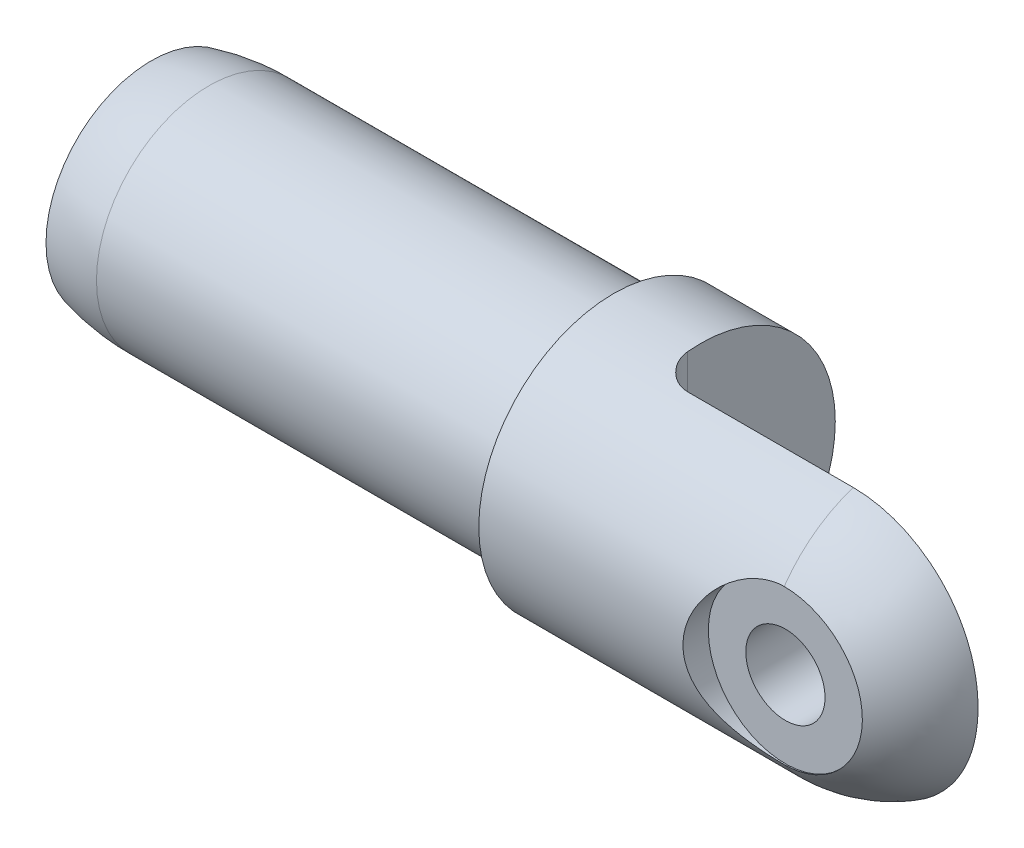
ISO-10303-21;
HEADER;
FILE_DESCRIPTION(('STEP AP214'),'2;1');
FILE_NAME('part.step','',(''),(''),'','','');
FILE_SCHEMA(('AUTOMOTIVE_DESIGN { 1 0 10303 214 1 1 1 1 }'));
ENDSEC;
DATA;
#1=APPLICATION_CONTEXT('core data for automotive mechanical design processes');
#2=APPLICATION_PROTOCOL_DEFINITION('international standard','automotive_design',2000,#1);
#3=PRODUCT_CONTEXT('',#1,'mechanical');
#4=PRODUCT('Part','Part','',(#3));
#5=PRODUCT_RELATED_PRODUCT_CATEGORY('part','',(#4));
#6=PRODUCT_DEFINITION_FORMATION('','',#4);
#7=PRODUCT_DEFINITION_CONTEXT('part definition',#1,'design');
#8=PRODUCT_DEFINITION('design','',#6,#7);
#9=PRODUCT_DEFINITION_SHAPE('','',#8);
#10=(LENGTH_UNIT() NAMED_UNIT(*) SI_UNIT(.MILLI.,.METRE.));
#11=(NAMED_UNIT(*) PLANE_ANGLE_UNIT() SI_UNIT($,.RADIAN.));
#12=(NAMED_UNIT(*) SI_UNIT($,.STERADIAN.) SOLID_ANGLE_UNIT());
#13=UNCERTAINTY_MEASURE_WITH_UNIT(LENGTH_MEASURE(1.E-05),#10,'distance_accuracy_value','');
#14=(GEOMETRIC_REPRESENTATION_CONTEXT(3) GLOBAL_UNCERTAINTY_ASSIGNED_CONTEXT((#13)) GLOBAL_UNIT_ASSIGNED_CONTEXT((#10,
#11,#12)) REPRESENTATION_CONTEXT('',''));
#15=CARTESIAN_POINT('',(0.,0.,0.));
#16=DIRECTION('',(0.,0.,1.));
#17=DIRECTION('',(1.,0.,0.));
#18=AXIS2_PLACEMENT_3D('',#15,#16,#17);
#19=CARTESIAN_POINT('',(-57.15,0.,0.));
#20=DIRECTION('',(-1.,0.,0.));
#21=DIRECTION('',(0.,0.,1.));
#22=AXIS2_PLACEMENT_3D('',#19,#20,#21);
#23=CYLINDRICAL_SURFACE('',#22,11.1125);
#24=CARTESIAN_POINT('',(-19.05,0.,0.));
#25=DIRECTION('',(-1.,0.,0.));
#26=DIRECTION('',(0.,0.,1.));
#27=AXIS2_PLACEMENT_3D('',#24,#25,#26);
#28=CIRCLE('',#27,11.1125);
#29=CARTESIAN_POINT('',(-19.05,0.,11.1125));
#30=VERTEX_POINT('',#29);
#31=EDGE_CURVE('E84',#30,#30,#28,.T.);
#32=ORIENTED_EDGE('',*,*,#31,.F.);
#33=EDGE_LOOP('',(#32));
#34=FACE_BOUND('',#33,.T.);
#35=CARTESIAN_POINT('',(4.11479999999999,0.,0.));
#36=DIRECTION('',(-1.,0.,0.));
#37=DIRECTION('',(0.,0.,1.));
#38=AXIS2_PLACEMENT_3D('',#35,#36,#37);
#39=CIRCLE('',#38,11.1125);
#40=CARTESIAN_POINT('',(4.11479999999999,-10.5702230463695,3.429));
#41=VERTEX_POINT('',#40);
#42=CARTESIAN_POINT('',(4.11479999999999,-6.35,9.11949320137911));
#43=VERTEX_POINT('',#42);
#44=EDGE_CURVE('E70',#41,#43,#39,.T.);
#45=ORIENTED_EDGE('',*,*,#44,.T.);
#46=CARTESIAN_POINT('',(4.11479999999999,-6.35,9.11949320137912));
#47=CARTESIAN_POINT('',(3.95245216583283,-6.35003519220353,9.11943048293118));
#48=CARTESIAN_POINT('',(3.79013647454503,-6.34377573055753,9.12382649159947));
#49=CARTESIAN_POINT('',(3.46703616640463,-6.31894061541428,9.14106440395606));
#50=CARTESIAN_POINT('',(3.30625036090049,-6.3003754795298,9.15389909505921));
#51=CARTESIAN_POINT('',(2.98855842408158,-6.25138072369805,9.18742152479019));
#52=CARTESIAN_POINT('',(2.83163254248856,-6.2210386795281,9.20805126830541));
#53=CARTESIAN_POINT('',(2.52152588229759,-6.1489283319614,9.25636156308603));
#54=CARTESIAN_POINT('',(2.3683457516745,-6.10715806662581,9.28404332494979));
#55=CARTESIAN_POINT('',(2.06717373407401,-6.01286476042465,9.34538693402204));
#56=CARTESIAN_POINT('',(1.91916581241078,-5.96037920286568,9.37902788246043));
#57=CARTESIAN_POINT('',(1.6284581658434,-5.8450898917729,9.45130733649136));
#58=CARTESIAN_POINT('',(1.48576053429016,-5.78228212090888,9.48994778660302));
#59=CARTESIAN_POINT('',(1.06610381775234,-5.57894727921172,9.61186755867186));
#60=CARTESIAN_POINT('',(0.797911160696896,-5.42361342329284,9.7010739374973));
#61=CARTESIAN_POINT('',(0.260802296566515,-5.05825288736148,9.89692430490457));
#62=CARTESIAN_POINT('',(-0.00500695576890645,-4.84411041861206,10.0044091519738));
#63=CARTESIAN_POINT('',(-0.375599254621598,-4.4930846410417,10.1644716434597));
#64=CARTESIAN_POINT('',(-0.494495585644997,-4.3710387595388,10.2176580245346));
#65=CARTESIAN_POINT('',(-0.722441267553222,-4.11736164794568,10.3224900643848));
#66=CARTESIAN_POINT('',(-0.831488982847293,-3.98572883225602,10.3741354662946));
#67=CARTESIAN_POINT('',(-1.04897309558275,-3.70042183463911,10.4794950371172));
#68=CARTESIAN_POINT('',(-1.15635778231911,-3.54584305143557,10.5329361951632));
#69=CARTESIAN_POINT('',(-1.3575472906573,-3.22668223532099,10.6350473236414));
#70=CARTESIAN_POINT('',(-1.45135807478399,-3.06210463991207,10.6837193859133));
#71=CARTESIAN_POINT('',(-1.62444400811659,-2.72390294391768,10.7749092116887));
#72=CARTESIAN_POINT('',(-1.70372403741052,-2.55028190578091,10.8174290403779));
#73=CARTESIAN_POINT('',(-1.8467743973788,-2.19516653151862,10.8950407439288));
#74=CARTESIAN_POINT('',(-1.91054699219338,-2.01367334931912,10.9301337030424));
#75=CARTESIAN_POINT('',(-2.01673134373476,-1.66064276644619,10.9890427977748));
#76=CARTESIAN_POINT('',(-2.06053305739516,-1.48964359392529,11.0135815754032));
#77=CARTESIAN_POINT('',(-2.13386007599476,-1.14368027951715,11.0548626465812));
#78=CARTESIAN_POINT('',(-2.16338614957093,-0.968716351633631,11.071605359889));
#79=CARTESIAN_POINT('',(-2.20769708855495,-0.616459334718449,11.0967920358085));
#80=CARTESIAN_POINT('',(-2.22249206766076,-0.43916792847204,11.1052416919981));
#81=CARTESIAN_POINT('',(-2.23713690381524,-0.0837738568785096,11.1136051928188));
#82=CARTESIAN_POINT('',(-2.23698807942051,0.0943287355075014,11.113519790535));
#83=CARTESIAN_POINT('',(-2.22261782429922,0.429556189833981,11.1053138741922));
#84=CARTESIAN_POINT('',(-2.20999033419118,0.586774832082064,11.0981034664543));
#85=CARTESIAN_POINT('',(-2.17314533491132,0.899461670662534,11.0771468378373));
#86=CARTESIAN_POINT('',(-2.14892400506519,1.05492927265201,11.0633984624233));
#87=CARTESIAN_POINT('',(-2.08919281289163,1.36292873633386,11.0296906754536));
#88=CARTESIAN_POINT('',(-2.05368702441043,1.51546163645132,11.0097335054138));
#89=CARTESIAN_POINT('',(-1.97177046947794,1.81673971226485,10.9640476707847));
#90=CARTESIAN_POINT('',(-1.92535550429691,1.96548340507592,10.9383167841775));
#91=CARTESIAN_POINT('',(-1.82166232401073,2.25951683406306,10.8813990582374));
#92=CARTESIAN_POINT('',(-1.76429576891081,2.40476684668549,10.8501680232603));
#93=CARTESIAN_POINT('',(-1.63948711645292,2.68977951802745,10.7830523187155));
#94=CARTESIAN_POINT('',(-1.57204141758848,2.8295401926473,10.7471659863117));
#95=CARTESIAN_POINT('',(-1.35541030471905,3.23955794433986,10.6335864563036));
#96=CARTESIAN_POINT('',(-1.19186207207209,3.50074373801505,10.5499339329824));
#97=CARTESIAN_POINT('',(-0.810440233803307,4.02251441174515,10.3630314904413));
#98=CARTESIAN_POINT('',(-0.58851706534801,4.27969924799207,10.2586352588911));
#99=CARTESIAN_POINT('',(-0.106896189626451,4.75546197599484,10.0469424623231));
#100=CARTESIAN_POINT('',(0.152853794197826,4.97398549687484,9.93964205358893));
#101=CARTESIAN_POINT('',(0.581226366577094,5.279325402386,9.77913370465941));
#102=CARTESIAN_POINT('',(0.738344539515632,5.3811988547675,9.72328640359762));
#103=CARTESIAN_POINT('',(1.06210862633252,5.57124703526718,9.6156523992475));
#104=CARTESIAN_POINT('',(1.22875694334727,5.6594182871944,9.56386672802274));
#105=CARTESIAN_POINT('',(1.570232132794,5.82093297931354,9.46642911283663));
#106=CARTESIAN_POINT('',(1.74503592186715,5.894315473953,9.42076112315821));
#107=CARTESIAN_POINT('',(2.10208878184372,6.02558009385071,9.33734951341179));
#108=CARTESIAN_POINT('',(2.28433169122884,6.08347475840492,9.29959948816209));
#109=CARTESIAN_POINT('',(2.60198422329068,6.16868590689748,9.24320175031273));
#110=CARTESIAN_POINT('',(2.73591021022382,6.20001345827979,9.22217733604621));
#111=CARTESIAN_POINT('',(3.00621587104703,6.25400089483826,9.18565120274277));
#112=CARTESIAN_POINT('',(3.14259479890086,6.27666337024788,9.17014783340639));
#113=CARTESIAN_POINT('',(3.41777363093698,6.31316054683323,9.14506330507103));
#114=CARTESIAN_POINT('',(3.55658223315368,6.32695052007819,9.13551215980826));
#115=CARTESIAN_POINT('',(3.83518797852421,6.34538317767,9.12270745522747));
#116=CARTESIAN_POINT('',(3.97498573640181,6.35001955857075,9.11945823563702));
#117=CARTESIAN_POINT('',(4.11479999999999,6.34999999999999,9.11949320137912));
#118=B_SPLINE_CURVE_WITH_KNOTS('',3,(#46,#47,#48,#49,#50,#51,#52,#53,#54,#55,#56,#57,#58,#59,
#60,#61,#62,#63,#64,#65,#66,#67,#68,#69,#70,#71,#72,#73,#74,#75,#76,#77,#78,#79,#80,#81,#82,#83,
#84,#85,#86,#87,#88,#89,#90,#91,#92,#93,#94,#95,#96,#97,#98,#99,#100,#101,#102,#103,#104,#105,
#106,#107,#108,#109,#110,#111,#112,#113,#114,#115,#116,#117),.UNSPECIFIED.,.F.,.F.,(4,2,2,2,2,2,
2,2,2,2,2,2,2,2,2,2,2,2,2,2,2,2,2,2,2,2,2,2,2,2,2,2,2,2,2,4),(0.,0.486812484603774,
0.973209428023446,1.45605664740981,1.93898681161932,2.42025571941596,2.90171237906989,
3.86567559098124,4.93470118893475,5.46975023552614,6.00488797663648,6.59110109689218,
7.17705592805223,7.76281360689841,8.34848571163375,8.88238361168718,9.41625276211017,
9.94975512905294,10.4832104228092,10.95631584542,11.4295772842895,11.9026680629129,
12.3759412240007,12.8532069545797,13.3306436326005,14.2848979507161,15.3469359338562,
16.4104558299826,16.9960458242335,17.5817841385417,18.1659547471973,18.7496509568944,
19.1667031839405,19.5836306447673,20.002643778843,20.4219453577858),.UNSPECIFIED.);
#119=CARTESIAN_POINT('',(4.11479999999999,6.34999999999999,9.11949320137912));
#120=VERTEX_POINT('',#119);
#121=EDGE_CURVE('E37',#43,#120,#118,.T.);
#122=ORIENTED_EDGE('',*,*,#121,.T.);
#123=CARTESIAN_POINT('',(4.11479999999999,10.5702230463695,3.429));
#124=VERTEX_POINT('',#123);
#125=EDGE_CURVE('E43',#120,#124,#39,.T.);
#126=ORIENTED_EDGE('',*,*,#125,.T.);
#127=DIRECTION('',(-1.,0.,0.));
#128=VECTOR('',#127,1.);
#129=CARTESIAN_POINT('',(-57.15,10.5702230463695,3.429));
#130=LINE('',#129,#128);
#131=CARTESIAN_POINT('',(-9.52499999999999,10.5702230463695,3.429));
#132=VERTEX_POINT('',#131);
#133=EDGE_CURVE('E79',#132,#124,#130,.F.);
#134=ORIENTED_EDGE('',*,*,#133,.F.);
#135=CARTESIAN_POINT('',(-11.90625,11.0629958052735,1.04774999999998));
#136=CARTESIAN_POINT('',(-11.9062503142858,11.05663096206,1.11499195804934));
#137=CARTESIAN_POINT('',(-11.9034002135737,11.049648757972,1.18213996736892));
#138=CARTESIAN_POINT('',(-11.8920647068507,11.0345277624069,1.3158136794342));
#139=CARTESIAN_POINT('',(-11.8835804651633,11.0263892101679,1.38233950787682));
#140=CARTESIAN_POINT('',(-11.8498349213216,11.0003995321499,1.58001133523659));
#141=CARTESIAN_POINT('',(-11.8162800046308,10.9809385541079,1.70962574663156));
#142=CARTESIAN_POINT('',(-11.7282515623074,10.9388728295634,1.96086384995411));
#143=CARTESIAN_POINT('',(-11.6737834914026,10.9162689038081,2.08248961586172));
#144=CARTESIAN_POINT('',(-11.5455335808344,10.8693808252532,2.31479260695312));
#145=CARTESIAN_POINT('',(-11.4717455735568,10.845096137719,2.42546632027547));
#146=CARTESIAN_POINT('',(-11.3051331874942,10.7960916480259,2.63512866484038));
#147=CARTESIAN_POINT('',(-11.2119542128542,10.7713729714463,2.73383592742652));
#148=CARTESIAN_POINT('',(-11.0098838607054,10.7239701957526,2.91424756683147));
#149=CARTESIAN_POINT('',(-10.9009901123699,10.7012864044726,2.99594937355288));
#150=CARTESIAN_POINT('',(-10.6703312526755,10.6599424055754,3.13989031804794));
#151=CARTESIAN_POINT('',(-10.5485673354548,10.6412818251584,3.20213125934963));
#152=CARTESIAN_POINT('',(-10.2955843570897,10.6097878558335,3.30499270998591));
#153=CARTESIAN_POINT('',(-10.1643760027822,10.5969479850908,3.34563727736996));
#154=CARTESIAN_POINT('',(-9.94761988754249,10.5819352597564,3.39273567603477));
#155=CARTESIAN_POINT('',(-9.8637070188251,10.5775623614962,3.40631529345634));
#156=CARTESIAN_POINT('',(-9.69487901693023,10.5716990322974,3.42445095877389));
#157=CARTESIAN_POINT('',(-9.60996470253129,10.5702063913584,3.42901392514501));
#158=CARTESIAN_POINT('',(-9.52499999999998,10.5702230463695,3.429));
#159=B_SPLINE_CURVE_WITH_KNOTS('',3,(#135,#136,#137,#138,#139,#140,#141,#142,#143,#144,#145,
#146,#147,#148,#149,#150,#151,#152,#153,#154,#155,#156,#157,#158),.UNSPECIFIED.,.F.,.F.,(4,2,2,
2,2,2,2,2,2,2,2,4),(0.,0.202496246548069,0.404950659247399,0.808746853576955,1.21243779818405,
1.61625777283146,2.02823917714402,2.44028280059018,2.85228822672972,3.26383371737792,
3.51869225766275,3.77335516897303),.UNSPECIFIED.);
#160=CARTESIAN_POINT('',(-11.90625,11.0629958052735,1.04774999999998));
#161=VERTEX_POINT('',#160);
#162=EDGE_CURVE('E136',#161,#132,#159,.T.);
#163=ORIENTED_EDGE('',*,*,#162,.F.);
#164=CARTESIAN_POINT('',(-11.90625,0.,0.));
#165=DIRECTION('',(-1.,0.,0.));
#166=DIRECTION('',(0.,0.,1.));
#167=AXIS2_PLACEMENT_3D('',#164,#165,#166);
#168=CIRCLE('',#167,11.1125);
#169=CARTESIAN_POINT('',(-11.90625,-11.0629958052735,1.04774999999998));
#170=VERTEX_POINT('',#169);
#171=EDGE_CURVE('E117',#170,#161,#168,.F.);
#172=ORIENTED_EDGE('',*,*,#171,.F.);
#173=CARTESIAN_POINT('',(-9.52499999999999,-10.5702230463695,3.429));
#174=CARTESIAN_POINT('',(-9.59007757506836,-10.5702157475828,3.42900820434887));
#175=CARTESIAN_POINT('',(-9.6551501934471,-10.5710883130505,3.42633237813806));
#176=CARTESIAN_POINT('',(-9.78480089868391,-10.574538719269,3.41567627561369));
#177=CARTESIAN_POINT('',(-9.84937908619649,-10.5771162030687,3.40769710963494));
#178=CARTESIAN_POINT('',(-9.97742078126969,-10.5839133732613,3.3865248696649));
#179=CARTESIAN_POINT('',(-10.040886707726,-10.5881288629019,3.37334511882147));
#180=CARTESIAN_POINT('',(-10.1664067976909,-10.5980944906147,3.34190357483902));
#181=CARTESIAN_POINT('',(-10.2284609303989,-10.6038446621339,3.32364167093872));
#182=CARTESIAN_POINT('',(-10.4118261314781,-10.6232034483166,3.26145883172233));
#183=CARTESIAN_POINT('',(-10.5304929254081,-10.6389289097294,3.21011519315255));
#184=CARTESIAN_POINT('',(-10.7574606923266,-10.674632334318,3.08930796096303));
#185=CARTESIAN_POINT('',(-10.8657571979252,-10.6946121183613,3.01983660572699));
#186=CARTESIAN_POINT('',(-11.0723438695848,-10.7378048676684,2.86252103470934));
#187=CARTESIAN_POINT('',(-11.1702675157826,-10.7610928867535,2.77421554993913));
#188=CARTESIAN_POINT('',(-11.3501554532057,-10.8086281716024,2.58281333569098));
#189=CARTESIAN_POINT('',(-11.432114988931,-10.8328757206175,2.47971221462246));
#190=CARTESIAN_POINT('',(-11.5804798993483,-10.8813670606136,2.25761808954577));
#191=CARTESIAN_POINT('',(-11.6462702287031,-10.9055833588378,2.13820755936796));
#192=CARTESIAN_POINT('',(-11.7566403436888,-10.9514037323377,1.88953875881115));
#193=CARTESIAN_POINT('',(-11.801235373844,-10.9730096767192,1.7602876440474));
#194=CARTESIAN_POINT('',(-11.8582273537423,-11.0066031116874,1.53345035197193));
#195=CARTESIAN_POINT('',(-11.8761838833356,-11.0195747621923,1.43737154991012));
#196=CARTESIAN_POINT('',(-11.9002035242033,-11.0431429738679,1.24350721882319));
#197=CARTESIAN_POINT('',(-11.9062728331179,-11.053740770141,1.14572260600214));
#198=CARTESIAN_POINT('',(-11.90625,-11.0629958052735,1.04774999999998));
#199=B_SPLINE_CURVE_WITH_KNOTS('',3,(#173,#174,#175,#176,#177,#178,#179,#180,#181,#182,#183,
#184,#185,#186,#187,#188,#189,#190,#191,#192,#193,#194,#195,#196,#197,#198),.UNSPECIFIED.,.F.,
.F.,(4,2,2,2,2,2,2,2,2,2,2,2,4),(0.,0.195163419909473,0.390285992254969,0.584911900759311,
0.779542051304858,1.1683423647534,1.55730942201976,1.95720233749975,2.35721419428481,
2.77066448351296,3.18381695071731,3.4788926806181,3.77381452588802),.UNSPECIFIED.);
#200=CARTESIAN_POINT('',(-9.52499999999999,-10.5702230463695,3.429));
#201=VERTEX_POINT('',#200);
#202=EDGE_CURVE('E31',#201,#170,#199,.T.);
#203=ORIENTED_EDGE('',*,*,#202,.F.);
#204=DIRECTION('',(-1.,0.,0.));
#205=VECTOR('',#204,1.);
#206=CARTESIAN_POINT('',(-57.15,-10.5702230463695,3.429));
#207=LINE('',#206,#205);
#208=EDGE_CURVE('E85',#41,#201,#207,.T.);
#209=ORIENTED_EDGE('',*,*,#208,.F.);
#210=EDGE_LOOP('',(#45,#122,#126,#134,#163,#172,#203,#209));
#211=FACE_BOUND('',#210,.T.);
#212=ADVANCED_FACE('F17',(#34,#211),#23,.T.);
#213=CARTESIAN_POINT('',(4.11479999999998,0.,0.));
#214=DIRECTION('',(-1.,0.,0.));
#215=DIRECTION('',(0.,0.,1.));
#216=AXIS2_PLACEMENT_3D('',#213,#214,#215);
#217=DEGENERATE_TOROIDAL_SURFACE('',#216,0.396874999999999,10.715625,.T.);
#218=ORIENTED_EDGE('',*,*,#125,.F.);
#219=CARTESIAN_POINT('',(3.50520673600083,6.32067212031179,9.11873796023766));
#220=CARTESIAN_POINT('',(3.68293046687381,6.33783189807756,9.11918014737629));
#221=CARTESIAN_POINT('',(3.86137848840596,6.34745799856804,9.11942790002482));
#222=CARTESIAN_POINT('',(4.21844350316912,6.35165876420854,9.11953572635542));
#223=CARTESIAN_POINT('',(4.39706048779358,6.34623415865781,9.11939581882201));
#224=CARTESIAN_POINT('',(4.75307408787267,6.32036033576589,9.11872979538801));
#225=CARTESIAN_POINT('',(4.93047148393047,6.29992185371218,9.11820395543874));
#226=CARTESIAN_POINT('',(5.28291225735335,6.24418441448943,9.1167776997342));
#227=CARTESIAN_POINT('',(5.45795566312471,6.20888563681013,9.11587728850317));
#228=CARTESIAN_POINT('',(5.8044963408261,6.12366514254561,9.11372030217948));
#229=CARTESIAN_POINT('',(5.97599259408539,6.07373928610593,9.11246362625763));
#230=CARTESIAN_POINT('',(6.31423177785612,5.95960313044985,9.10962055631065));
#231=CARTESIAN_POINT('',(6.48097292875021,5.89538756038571,9.10803404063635));
#232=CARTESIAN_POINT('',(6.80835819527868,5.75317977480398,9.10456736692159));
#233=CARTESIAN_POINT('',(6.96900568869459,5.67519533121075,9.10268737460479));
#234=CARTESIAN_POINT('',(7.28322035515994,5.50594841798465,9.09867497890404));
#235=CARTESIAN_POINT('',(7.43678489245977,5.41468105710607,9.09654248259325));
#236=CARTESIAN_POINT('',(7.73565165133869,5.21955707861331,9.09207637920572));
#237=CARTESIAN_POINT('',(7.88095541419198,5.11570282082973,9.08974280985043));
#238=CARTESIAN_POINT('',(8.16235249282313,4.89608866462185,9.08493092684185));
#239=CARTESIAN_POINT('',(8.2984423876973,4.78032438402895,9.08245256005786));
#240=CARTESIAN_POINT('',(8.5603581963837,4.53777076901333,9.07741678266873));
#241=CARTESIAN_POINT('',(8.68618631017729,4.41098380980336,9.07485938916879));
#242=CARTESIAN_POINT('',(8.92676247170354,4.14721492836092,9.06973420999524));
#243=CARTESIAN_POINT('',(9.04150640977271,4.01022925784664,9.06716642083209));
#244=CARTESIAN_POINT('',(9.25903132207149,3.72709671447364,9.06209632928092));
#245=CARTESIAN_POINT('',(9.36181393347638,3.58095109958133,9.05959401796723));
#246=CARTESIAN_POINT('',(9.55473976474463,3.28046425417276,9.05473065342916));
#247=CARTESIAN_POINT('',(9.64487830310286,3.12612001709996,9.05236965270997));
#248=CARTESIAN_POINT('',(9.81179332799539,2.81044991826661,9.04786798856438));
#249=CARTESIAN_POINT('',(9.88857559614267,2.64912711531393,9.04572722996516));
#250=CARTESIAN_POINT('',(10.0283056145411,2.32052658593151,9.04173787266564));
#251=CARTESIAN_POINT('',(10.0912482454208,2.15324668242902,9.03988938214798));
#252=CARTESIAN_POINT('',(10.2027881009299,1.81404151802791,9.03655358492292));
#253=CARTESIAN_POINT('',(10.2513919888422,1.64211845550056,9.03506611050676));
#254=CARTESIAN_POINT('',(10.3339639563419,1.29476680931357,9.03250613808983));
#255=CARTESIAN_POINT('',(10.3679265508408,1.11933693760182,9.03143379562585));
#256=CARTESIAN_POINT('',(10.4473952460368,0.589805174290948,9.0289101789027));
#257=CARTESIAN_POINT('',(10.4706009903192,0.232098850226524,9.02814859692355));
#258=CARTESIAN_POINT('',(10.4565409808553,-0.48195464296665,9.02860289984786));
#259=CARTESIAN_POINT('',(10.4193033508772,-0.838302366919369,9.02981786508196));
#260=CARTESIAN_POINT('',(10.3191397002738,-1.36405464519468,9.03296678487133));
#261=CARTESIAN_POINT('',(10.2783341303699,-1.53793303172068,9.03423852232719));
#262=CARTESIAN_POINT('',(10.1822389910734,-1.88161321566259,9.03717231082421));
#263=CARTESIAN_POINT('',(10.1269548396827,-2.0514165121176,9.03883421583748));
#264=CARTESIAN_POINT('',(10.0022663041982,-2.38581422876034,9.04248840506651));
#265=CARTESIAN_POINT('',(9.93285658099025,-2.55040665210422,9.04448081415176));
#266=CARTESIAN_POINT('',(9.78045155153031,-2.8731021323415,9.04872400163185));
#267=CARTESIAN_POINT('',(9.69746126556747,-3.03120756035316,9.05097468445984));
#268=CARTESIAN_POINT('',(9.51842882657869,-3.33993284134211,9.05566048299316));
#269=CARTESIAN_POINT('',(9.42238118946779,-3.49054951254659,9.05809567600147));
#270=CARTESIAN_POINT('',(9.21798097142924,-3.78310371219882,9.063071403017));
#271=CARTESIAN_POINT('',(9.10963293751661,-3.92504441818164,9.06561189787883));
#272=CARTESIAN_POINT('',(8.88127467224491,-4.1994170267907,9.07072521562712));
#273=CARTESIAN_POINT('',(8.76125457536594,-4.33184071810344,9.07329806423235));
#274=CARTESIAN_POINT('',(8.51052912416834,-4.58605779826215,9.07840022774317));
#275=CARTESIAN_POINT('',(8.37982772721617,-4.70785508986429,9.08092955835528));
#276=CARTESIAN_POINT('',(8.10859183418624,-4.94004102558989,9.08587873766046));
#277=CARTESIAN_POINT('',(7.96805463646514,-5.05042651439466,9.0882985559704));
#278=CARTESIAN_POINT('',(7.67823132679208,-5.25892697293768,9.09296570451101));
#279=CARTESIAN_POINT('',(7.52894846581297,-5.35704646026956,9.09521309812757));
#280=CARTESIAN_POINT('',(7.22256811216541,-5.54041214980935,9.09948317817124));
#281=CARTESIAN_POINT('',(7.0654666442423,-5.62565171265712,9.10150574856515));
#282=CARTESIAN_POINT('',(6.74469613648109,-5.78256107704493,9.10527727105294));
#283=CARTESIAN_POINT('',(6.58102955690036,-5.85423590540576,9.10702632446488));
#284=CARTESIAN_POINT('',(6.24817723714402,-5.98356867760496,9.11021325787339));
#285=CARTESIAN_POINT('',(6.07898946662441,-6.04122139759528,9.11165102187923));
#286=CARTESIAN_POINT('',(5.73642009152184,-6.1420445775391,9.11418287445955));
#287=CARTESIAN_POINT('',(5.56304024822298,-6.18522101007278,9.11527710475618));
#288=CARTESIAN_POINT('',(5.23361903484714,-6.25265004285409,9.11699352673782));
#289=CARTESIAN_POINT('',(5.07790645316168,-6.27851955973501,9.11765581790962));
#290=CARTESIAN_POINT('',(4.76499594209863,-6.31859341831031,9.11868400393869));
#291=CARTESIAN_POINT('',(4.60779814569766,-6.33279879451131,9.11904992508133));
#292=CARTESIAN_POINT('',(4.29282280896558,-6.34946168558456,9.11947918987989));
#293=CARTESIAN_POINT('',(4.13504542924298,-6.35192224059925,9.11954261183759));
#294=CARTESIAN_POINT('',(3.81972608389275,-6.34510376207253,9.11936709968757));
#295=CARTESIAN_POINT('',(3.66218414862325,-6.33582332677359,9.11912812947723));
#296=CARTESIAN_POINT('',(3.50520673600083,-6.3206721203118,9.11873796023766));
#297=B_SPLINE_CURVE_WITH_KNOTS('',3,(#219,#220,#221,#222,#223,#224,#225,#226,#227,#228,#229,
#230,#231,#232,#233,#234,#235,#236,#237,#238,#239,#240,#241,#242,#243,#244,#245,#246,#247,#248,
#249,#250,#251,#252,#253,#254,#255,#256,#257,#258,#259,#260,#261,#262,#263,#264,#265,#266,#267,
#268,#269,#270,#271,#272,#273,#274,#275,#276,#277,#278,#279,#280,#281,#282,#283,#284,#285,#286,
#287,#288,#289,#290,#291,#292,#293,#294,#295,#296),.UNSPECIFIED.,.F.,.F.,(4,2,2,2,2,2,2,2,2,2,2,
2,2,2,2,2,2,2,2,2,2,2,2,2,2,2,2,2,2,2,2,2,2,2,2,2,2,2,4),(0.,0.535488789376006,1.0709516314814,
1.60603197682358,2.14110585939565,2.6763313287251,3.21175454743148,3.74687650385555,
4.28219601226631,4.8174153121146,5.35283224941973,5.88813409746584,6.4236336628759,
6.95905984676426,7.49468375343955,8.03007522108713,8.56566440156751,9.10100429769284,
9.63654457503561,10.7064959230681,11.7759495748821,12.3112400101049,12.8463304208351,
13.3816234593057,13.9167190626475,14.4520401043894,14.9871638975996,15.5227439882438,
16.0581265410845,16.593656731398,17.1289891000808,17.6645964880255,18.2000050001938,
18.7356126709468,19.2709990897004,19.7441160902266,20.2171911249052,20.6901436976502,
21.1631527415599),.UNSPECIFIED.);
#298=EDGE_CURVE('E11',#120,#43,#297,.T.);
#299=ORIENTED_EDGE('',*,*,#298,.T.);
#300=ORIENTED_EDGE('',*,*,#44,.F.);
#301=CARTESIAN_POINT('',(14.3924863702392,0.,3.429));
#302=CARTESIAN_POINT('',(14.3924883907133,-0.296523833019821,3.429));
#303=CARTESIAN_POINT('',(14.3811602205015,-0.593084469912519,3.429));
#304=CARTESIAN_POINT('',(14.3355917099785,-1.18447514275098,3.429));
#305=CARTESIAN_POINT('',(14.3013483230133,-1.47930494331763,3.429));
#306=CARTESIAN_POINT('',(14.2094463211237,-2.06537646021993,3.429));
#307=CARTESIAN_POINT('',(14.1517831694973,-2.35661747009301,3.429));
#308=CARTESIAN_POINT('',(14.0127562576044,-2.93338330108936,3.429));
#309=CARTESIAN_POINT('',(13.9313939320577,-3.21890846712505,3.429));
#310=CARTESIAN_POINT('',(13.7447862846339,-3.78293002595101,3.429));
#311=CARTESIAN_POINT('',(13.6394758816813,-4.06140492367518,3.429));
#312=CARTESIAN_POINT('',(13.4055304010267,-4.60839709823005,3.429));
#313=CARTESIAN_POINT('',(13.2768946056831,-4.87691406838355,3.429));
#314=CARTESIAN_POINT('',(12.9970355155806,-5.40192846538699,3.429));
#315=CARTESIAN_POINT('',(12.8458112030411,-5.6584253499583,3.429));
#316=CARTESIAN_POINT('',(12.5217780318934,-6.1574018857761,3.429));
#317=CARTESIAN_POINT('',(12.3489695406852,-6.39988177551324,3.429));
#318=CARTESIAN_POINT('',(11.985883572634,-6.86523440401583,3.429));
#319=CARTESIAN_POINT('',(11.7959259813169,-7.08835678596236,3.429));
#320=CARTESIAN_POINT('',(11.3976218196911,-7.51753705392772,3.429));
#321=CARTESIAN_POINT('',(11.1892753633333,-7.72359504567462,3.429));
#322=CARTESIAN_POINT('',(10.7556987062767,-8.11709397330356,3.429));
#323=CARTESIAN_POINT('',(10.5304690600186,-8.30453552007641,3.429));
#324=CARTESIAN_POINT('',(10.064758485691,-8.65940252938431,3.429));
#325=CARTESIAN_POINT('',(9.82427770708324,-8.82682818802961,3.429));
#326=CARTESIAN_POINT('',(9.333854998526,-9.13785432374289,3.429));
#327=CARTESIAN_POINT('',(9.08413082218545,-9.28179828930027,3.429));
#328=CARTESIAN_POINT('',(8.57340786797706,-9.54805861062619,3.429));
#329=CARTESIAN_POINT('',(8.31240918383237,-9.67037514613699,3.429));
#330=CARTESIAN_POINT('',(7.7810150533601,-9.89248771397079,3.429));
#331=CARTESIAN_POINT('',(7.51062009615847,-9.99228491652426,3.429));
#332=CARTESIAN_POINT('',(6.96235521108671,-10.1686433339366,3.429));
#333=CARTESIAN_POINT('',(6.68448528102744,-10.2452045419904,3.429));
#334=CARTESIAN_POINT('',(6.12434316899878,-10.3742865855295,3.429));
#335=CARTESIAN_POINT('',(5.84209203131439,-10.4268987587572,3.429));
#336=CARTESIAN_POINT('',(5.27415919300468,-10.5081358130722,3.429));
#337=CARTESIAN_POINT('',(4.98847750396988,-10.5367607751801,3.429));
#338=CARTESIAN_POINT('',(4.41571521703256,-10.5698177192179,3.429));
#339=CARTESIAN_POINT('',(4.12863460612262,-10.574249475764,3.429));
#340=CARTESIAN_POINT('',(3.55512214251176,-10.5588875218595,3.429));
#341=CARTESIAN_POINT('',(3.26869028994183,-10.5390938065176,3.429));
#342=CARTESIAN_POINT('',(2.69879255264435,-10.4754542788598,3.429));
#343=CARTESIAN_POINT('',(2.41532406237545,-10.4316317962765,3.429));
#344=CARTESIAN_POINT('',(1.85308610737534,-10.3202653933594,3.429));
#345=CARTESIAN_POINT('',(1.57431663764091,-10.2527214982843,3.429));
#346=CARTESIAN_POINT('',(1.02346709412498,-10.0944005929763,3.429));
#347=CARTESIAN_POINT('',(0.751386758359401,-10.0036244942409,3.429));
#348=CARTESIAN_POINT('',(0.215833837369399,-9.79948999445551,3.429));
#349=CARTESIAN_POINT('',(-0.0476387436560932,-9.68613158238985,3.429));
#350=CARTESIAN_POINT('',(-0.564193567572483,-9.43760697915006,3.429));
#351=CARTESIAN_POINT('',(-0.817272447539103,-9.30243379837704,3.429));
#352=CARTESIAN_POINT('',(-1.31116170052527,-9.01127764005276,3.429));
#353=CARTESIAN_POINT('',(-1.55197207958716,-8.85529467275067,3.429));
#354=CARTESIAN_POINT('',(-2.01965648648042,-8.52362150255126,3.429));
#355=CARTESIAN_POINT('',(-2.24652891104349,-8.34792903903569,3.429));
#356=CARTESIAN_POINT('',(-2.6847199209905,-7.97811517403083,3.429));
#357=CARTESIAN_POINT('',(-2.89603847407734,-7.78399373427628,3.429));
#358=CARTESIAN_POINT('',(-3.30212424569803,-7.37825098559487,3.429));
#359=CARTESIAN_POINT('',(-3.49685217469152,-7.16659035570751,3.429));
#360=CARTESIAN_POINT('',(-3.86787324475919,-6.72768878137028,3.429));
#361=CARTESIAN_POINT('',(-4.04416642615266,-6.50044787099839,3.429));
#362=CARTESIAN_POINT('',(-4.37707261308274,-6.03212101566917,3.429));
#363=CARTESIAN_POINT('',(-4.53369348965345,-5.79104066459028,3.429));
#364=CARTESIAN_POINT('',(-4.82633827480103,-5.29668970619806,3.429));
#365=CARTESIAN_POINT('',(-4.96236204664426,-5.04341901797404,3.429));
#366=CARTESIAN_POINT('',(-5.21398402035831,-4.52451222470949,3.429));
#367=CARTESIAN_POINT('',(-5.32941643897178,-4.25879575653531,3.429));
#368=CARTESIAN_POINT('',(-5.53798624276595,-3.7187670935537,3.429));
#369=CARTESIAN_POINT('',(-5.63112396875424,-3.44445503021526,3.429));
#370=CARTESIAN_POINT('',(-5.79488990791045,-2.88899973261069,3.429));
#371=CARTESIAN_POINT('',(-5.86550283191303,-2.60785199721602,3.429));
#372=CARTESIAN_POINT('',(-5.98419975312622,-2.04085233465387,3.429));
#373=CARTESIAN_POINT('',(-6.03228263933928,-1.75500017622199,3.429));
#374=CARTESIAN_POINT('',(-6.10774812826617,-1.16901833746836,3.429));
#375=CARTESIAN_POINT('',(-6.13423328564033,-0.868772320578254,3.429));
#376=CARTESIAN_POINT('',(-6.16373824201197,-0.267233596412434,3.429));
#377=CARTESIAN_POINT('',(-6.16675656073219,0.0340591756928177,3.429));
#378=CARTESIAN_POINT('',(-6.14064779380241,0.937127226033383,3.429));
#379=CARTESIAN_POINT('',(-6.0764100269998,1.53851137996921,3.429));
#380=CARTESIAN_POINT('',(-5.90336562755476,2.44668193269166,3.429));
#381=CARTESIAN_POINT('',(-5.82914076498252,2.76050458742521,3.429));
#382=CARTESIAN_POINT('',(-5.65268441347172,3.3803246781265,3.429));
#383=CARTESIAN_POINT('',(-5.55045105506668,3.68632159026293,3.429));
#384=CARTESIAN_POINT('',(-5.31840152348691,4.2874861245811,3.429));
#385=CARTESIAN_POINT('',(-5.18859855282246,4.58265885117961,3.429));
#386=CARTESIAN_POINT('',(-4.90218311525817,5.15969795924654,3.429));
#387=CARTESIAN_POINT('',(-4.74557254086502,5.44156527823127,3.429));
#388=CARTESIAN_POINT('',(-4.4195324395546,5.96873500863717,3.429));
#389=CARTESIAN_POINT('',(-4.25196457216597,6.21519117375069,3.429));
#390=CARTESIAN_POINT('',(-3.89609341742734,6.69265227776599,3.429));
#391=CARTESIAN_POINT('',(-3.70779061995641,6.92365758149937,3.429));
#392=CARTESIAN_POINT('',(-3.31180499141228,7.36843336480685,3.429));
#393=CARTESIAN_POINT('',(-3.10412117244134,7.58220296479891,3.429));
#394=CARTESIAN_POINT('',(-2.67091847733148,7.99083757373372,3.429));
#395=CARTESIAN_POINT('',(-2.44539975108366,8.18570274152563,3.429));
#396=CARTESIAN_POINT('',(-1.98526219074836,8.54945155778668,3.429));
#397=CARTESIAN_POINT('',(-1.75112174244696,8.71894079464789,3.429));
#398=CARTESIAN_POINT('',(-1.26932694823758,9.03747715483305,3.429));
#399=CARTESIAN_POINT('',(-1.02167279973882,9.18652457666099,3.429));
#400=CARTESIAN_POINT('',(-0.514662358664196,9.46306820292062,3.429));
#401=CARTESIAN_POINT('',(-0.255307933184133,9.59056783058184,3.429));
#402=CARTESIAN_POINT('',(0.273279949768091,9.82311567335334,3.429));
#403=CARTESIAN_POINT('',(0.542513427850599,9.92816384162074,3.429));
#404=CARTESIAN_POINT('',(1.08733151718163,10.1144983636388,3.429));
#405=CARTESIAN_POINT('',(1.36287010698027,10.195919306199,3.429));
#406=CARTESIAN_POINT('',(1.91982788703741,10.3352241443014,3.429));
#407=CARTESIAN_POINT('',(2.20124693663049,10.3931086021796,3.429));
#408=CARTESIAN_POINT('',(2.76797782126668,10.4849278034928,3.429));
#409=CARTESIAN_POINT('',(3.05328982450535,10.5188615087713,3.429));
#410=CARTESIAN_POINT('',(3.62576001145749,10.562530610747,3.429));
#411=CARTESIAN_POINT('',(3.91291819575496,10.5722659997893,3.429));
#412=CARTESIAN_POINT('',(4.48658318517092,10.5674720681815,3.429));
#413=CARTESIAN_POINT('',(4.77309030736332,10.5529806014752,3.429));
#414=CARTESIAN_POINT('',(5.34386439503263,10.4999091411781,3.429));
#415=CARTESIAN_POINT('',(5.62813136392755,10.4613291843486,3.429));
#416=CARTESIAN_POINT('',(6.19239753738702,10.3603591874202,3.429));
#417=CARTESIAN_POINT('',(6.47239684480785,10.2979697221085,3.429));
#418=CARTESIAN_POINT('',(7.02614554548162,10.1498289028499,3.429));
#419=CARTESIAN_POINT('',(7.29989493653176,10.0640775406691,3.429));
#420=CARTESIAN_POINT('',(7.83919630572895,9.86983077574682,3.429));
#421=CARTESIAN_POINT('',(8.10474842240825,9.76133575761,3.429));
#422=CARTESIAN_POINT('',(8.6257784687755,9.52238055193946,3.429));
#423=CARTESIAN_POINT('',(8.88125640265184,9.39192037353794,3.429));
#424=CARTESIAN_POINT('',(9.38033441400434,9.10997135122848,3.429));
#425=CARTESIAN_POINT('',(9.62393439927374,8.95848234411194,3.429));
#426=CARTESIAN_POINT('',(10.0975388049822,8.63556541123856,3.429));
#427=CARTESIAN_POINT('',(10.3275432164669,8.46413747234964,3.429));
#428=CARTESIAN_POINT('',(10.7726609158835,8.1023185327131,3.429));
#429=CARTESIAN_POINT('',(10.9877526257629,7.91190098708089,3.429));
#430=CARTESIAN_POINT('',(11.4011879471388,7.5136792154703,3.429));
#431=CARTESIAN_POINT('',(11.599531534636,7.30587496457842,3.429));
#432=CARTESIAN_POINT('',(11.9781182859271,6.87436583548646,3.429));
#433=CARTESIAN_POINT('',(12.1583604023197,6.65066003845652,3.429));
#434=CARTESIAN_POINT('',(12.4995187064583,6.18897314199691,3.429));
#435=CARTESIAN_POINT('',(12.6604350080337,5.95099212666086,3.429));
#436=CARTESIAN_POINT('',(12.9627401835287,5.46111253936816,3.429));
#437=CARTESIAN_POINT('',(13.1040158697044,5.20914413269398,3.429));
#438=CARTESIAN_POINT('',(13.3651260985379,4.69432604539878,3.429));
#439=CARTESIAN_POINT('',(13.4849598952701,4.43147598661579,3.429));
#440=CARTESIAN_POINT('',(13.7024829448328,3.89699935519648,3.429));
#441=CARTESIAN_POINT('',(13.8001879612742,3.62537918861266,3.429));
#442=CARTESIAN_POINT('',(13.9732150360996,3.07513828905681,3.429));
#443=CARTESIAN_POINT('',(14.0485404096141,2.796518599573,3.429));
#444=CARTESIAN_POINT('',(14.1596686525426,2.30937303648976,3.429));
#445=CARTESIAN_POINT('',(14.2006540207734,2.1020099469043,3.429));
#446=CARTESIAN_POINT('',(14.2707302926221,1.685246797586,3.429));
#447=CARTESIAN_POINT('',(14.2998194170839,1.47584643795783,3.429));
#448=CARTESIAN_POINT('',(14.3462643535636,1.05567382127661,3.429));
#449=CARTESIAN_POINT('',(14.3636157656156,0.844901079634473,3.429));
#450=CARTESIAN_POINT('',(14.3867253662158,0.422758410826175,3.429));
#451=CARTESIAN_POINT('',(14.3924849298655,0.211388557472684,3.429));
#452=CARTESIAN_POINT('',(14.3924863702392,0.,3.429));
#453=B_SPLINE_CURVE_WITH_KNOTS('',3,(#301,#302,#303,#304,#305,#306,#307,#308,#309,#310,#311,
#312,#313,#314,#315,#316,#317,#318,#319,#320,#321,#322,#323,#324,#325,#326,#327,#328,#329,#330,
#331,#332,#333,#334,#335,#336,#337,#338,#339,#340,#341,#342,#343,#344,#345,#346,#347,#348,#349,
#350,#351,#352,#353,#354,#355,#356,#357,#358,#359,#360,#361,#362,#363,#364,#365,#366,#367,#368,
#369,#370,#371,#372,#373,#374,#375,#376,#377,#378,#379,#380,#381,#382,#383,#384,#385,#386,#387,
#388,#389,#390,#391,#392,#393,#394,#395,#396,#397,#398,#399,#400,#401,#402,#403,#404,#405,#406,
#407,#408,#409,#410,#411,#412,#413,#414,#415,#416,#417,#418,#419,#420,#421,#422,#423,#424,#425,
#426,#427,#428,#429,#430,#431,#432,#433,#434,#435,#436,#437,#438,#439,#440,#441,#442,#443,#444,
#445,#446,#447,#448,#449,#450,#451,#452),.UNSPECIFIED.,.T.,.F.,(4,2,2,2,2,2,2,2,2,2,2,2,2,2,2,2,
2,2,2,2,2,2,2,2,2,2,2,2,2,2,2,2,2,2,2,2,2,2,2,2,2,2,2,2,2,2,2,2,2,2,2,2,2,2,2,2,2,2,2,2,2,2,2,2,
2,2,2,2,2,2,2,2,2,2,2,4),(0.,0.889414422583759,1.77894711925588,2.66865221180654,
3.55830345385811,4.45040192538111,5.34252784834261,6.23469398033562,7.12684492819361,
8.00487127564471,8.88289218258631,9.76088426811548,10.6388677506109,11.5025581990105,
12.3662414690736,13.2298798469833,14.0935184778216,14.9538351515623,15.8141489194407,
16.674470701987,17.5347926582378,18.3942807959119,19.2537680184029,20.1132215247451,
20.9726754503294,21.8324052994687,22.6921347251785,23.5519628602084,24.4117927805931,
25.2736053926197,26.1354161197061,26.9968809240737,27.8583514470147,28.7264721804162,
29.5945796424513,30.4632751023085,31.3320133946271,32.2352356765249,33.1385149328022,
34.9438184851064,35.910219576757,36.8766851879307,37.8426890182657,38.8086246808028,
39.701602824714,40.5945598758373,41.4875624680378,42.3805575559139,43.2466675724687,
44.1127649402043,44.9787245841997,45.8446860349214,46.7056132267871,47.5665198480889,
48.4274637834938,49.2884079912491,50.1480082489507,51.0076071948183,51.8671853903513,
52.7267638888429,53.5863278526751,54.445891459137,55.3054617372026,56.1650325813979,
57.0258222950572,57.8866132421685,58.7474539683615,59.6082896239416,60.4738970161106,
61.3395345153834,62.2045534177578,63.069444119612,63.7032408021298,64.337132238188,
64.9712611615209,65.6053148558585),.UNSPECIFIED.);
#454=EDGE_CURVE('E77',#124,#41,#453,.T.);
#455=ORIENTED_EDGE('',*,*,#454,.F.);
#456=EDGE_LOOP('',(#218,#299,#300,#455));
#457=FACE_BOUND('',#456,.T.);
#458=ADVANCED_FACE('F76',(#457),#217,.T.);
#459=CARTESIAN_POINT('',(-19.05,0.,-9.271));
#460=DIRECTION('',(-1.,0.,0.));
#461=DIRECTION('',(0.,0.,1.));
#462=AXIS2_PLACEMENT_3D('',#459,#460,#461);
#463=PLANE('',#462);
#464=CARTESIAN_POINT('',(-19.05,0.,0.));
#465=DIRECTION('',(-1.,0.,0.));
#466=DIRECTION('',(0.,0.,1.));
#467=AXIS2_PLACEMENT_3D('',#464,#465,#466);
#468=CIRCLE('',#467,9.271);
#469=CARTESIAN_POINT('',(-19.05,0.,9.271));
#470=VERTEX_POINT('',#469);
#471=EDGE_CURVE('E104',#470,#470,#468,.T.);
#472=ORIENTED_EDGE('',*,*,#471,.F.);
#473=EDGE_LOOP('',(#472));
#474=FACE_BOUND('',#473,.T.);
#475=ORIENTED_EDGE('',*,*,#31,.T.);
#476=EDGE_LOOP('',(#475));
#477=FACE_BOUND('',#476,.T.);
#478=ADVANCED_FACE('F128',(#474,#477),#463,.T.);
#479=CARTESIAN_POINT('',(14.3924863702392,-25.4,3.429));
#480=DIRECTION('',(0.,0.,1.));
#481=DIRECTION('',(1.,0.,0.));
#482=AXIS2_PLACEMENT_3D('',#479,#480,#481);
#483=PLANE('',#482);
#484=CARTESIAN_POINT('',(4.11479999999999,0.,3.429));
#485=DIRECTION('',(0.,0.,1.));
#486=DIRECTION('',(1.,0.,0.));
#487=AXIS2_PLACEMENT_3D('',#484,#485,#486);
#488=CIRCLE('',#487,3.2639);
#489=CARTESIAN_POINT('',(7.37869999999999,0.,3.429));
#490=VERTEX_POINT('',#489);
#491=EDGE_CURVE('E72',#490,#490,#488,.T.);
#492=ORIENTED_EDGE('',*,*,#491,.T.);
#493=EDGE_LOOP('',(#492));
#494=FACE_BOUND('',#493,.T.);
#495=ORIENTED_EDGE('',*,*,#133,.T.);
#496=ORIENTED_EDGE('',*,*,#454,.T.);
#497=ORIENTED_EDGE('',*,*,#208,.T.);
#498=DIRECTION('',(0.,1.,0.));
#499=VECTOR('',#498,1.);
#500=CARTESIAN_POINT('',(-9.52499999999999,-25.4,3.429));
#501=LINE('',#500,#499);
#502=EDGE_CURVE('E161',#201,#132,#501,.T.);
#503=ORIENTED_EDGE('',*,*,#502,.T.);
#504=EDGE_LOOP('',(#495,#496,#497,#503));
#505=FACE_BOUND('',#504,.T.);
#506=ADVANCED_FACE('F122',(#494,#505),#483,.F.);
#507=CARTESIAN_POINT('',(-9.525,-25.4,1.04775));
#508=DIRECTION('',(0.,1.,0.));
#509=DIRECTION('',(0.,0.,1.));
#510=AXIS2_PLACEMENT_3D('',#507,#508,#509);
#511=CYLINDRICAL_SURFACE('',#510,2.38125);
#512=ORIENTED_EDGE('',*,*,#202,.T.);
#513=DIRECTION('',(0.,1.,0.));
#514=VECTOR('',#513,1.);
#515=CARTESIAN_POINT('',(-11.90625,-25.4,1.04774999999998));
#516=LINE('',#515,#514);
#517=EDGE_CURVE('E188',#170,#161,#516,.T.);
#518=ORIENTED_EDGE('',*,*,#517,.T.);
#519=ORIENTED_EDGE('',*,*,#162,.T.);
#520=ORIENTED_EDGE('',*,*,#502,.F.);
#521=EDGE_LOOP('',(#512,#518,#519,#520));
#522=FACE_BOUND('',#521,.T.);
#523=ADVANCED_FACE('F127',(#522),#511,.F.);
#524=CARTESIAN_POINT('',(-11.90625,-25.4,-11.1125));
#525=DIRECTION('',(-1.,0.,0.));
#526=DIRECTION('',(0.,0.,1.));
#527=AXIS2_PLACEMENT_3D('',#524,#525,#526);
#528=PLANE('',#527);
#529=ORIENTED_EDGE('',*,*,#517,.F.);
#530=ORIENTED_EDGE('',*,*,#171,.T.);
#531=EDGE_LOOP('',(#529,#530));
#532=FACE_BOUND('',#531,.T.);
#533=ADVANCED_FACE('F133',(#532),#528,.F.);
#534=CARTESIAN_POINT('',(4.11479999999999,0.,28.829));
#535=DIRECTION('',(0.,0.,-1.));
#536=DIRECTION('',(-1.,0.,0.));
#537=AXIS2_PLACEMENT_3D('',#534,#535,#536);
#538=CYLINDRICAL_SURFACE('',#537,3.2639);
#539=CARTESIAN_POINT('',(4.11479999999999,0.,9.017));
#540=DIRECTION('',(0.,0.,-1.));
#541=DIRECTION('',(-1.,0.,0.));
#542=AXIS2_PLACEMENT_3D('',#539,#540,#541);
#543=CIRCLE('',#542,3.2639);
#544=CARTESIAN_POINT('',(0.850899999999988,0.,9.017));
#545=VERTEX_POINT('',#544);
#546=EDGE_CURVE('E73',#545,#545,#543,.F.);
#547=ORIENTED_EDGE('',*,*,#546,.T.);
#548=EDGE_LOOP('',(#547));
#549=FACE_BOUND('',#548,.T.);
#550=ORIENTED_EDGE('',*,*,#491,.F.);
#551=EDGE_LOOP('',(#550));
#552=FACE_BOUND('',#551,.T.);
#553=ADVANCED_FACE('F130',(#549,#552),#538,.F.);
#554=CARTESIAN_POINT('',(4.11479999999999,0.,9.017));
#555=DIRECTION('',(0.,0.,-1.));
#556=DIRECTION('',(-1.,0.,0.));
#557=AXIS2_PLACEMENT_3D('',#554,#555,#556);
#558=PLANE('',#557);
#559=CARTESIAN_POINT('',(4.11479999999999,0.,9.017));
#560=DIRECTION('',(0.,0.,-1.));
#561=DIRECTION('',(-1.,0.,0.));
#562=AXIS2_PLACEMENT_3D('',#559,#560,#561);
#563=CIRCLE('',#562,6.35);
#564=CARTESIAN_POINT('',(-2.23520000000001,0.,9.017));
#565=VERTEX_POINT('',#564);
#566=EDGE_CURVE('E160',#565,#565,#563,.T.);
#567=ORIENTED_EDGE('',*,*,#566,.F.);
#568=EDGE_LOOP('',(#567));
#569=FACE_BOUND('',#568,.T.);
#570=ORIENTED_EDGE('',*,*,#546,.F.);
#571=EDGE_LOOP('',(#570));
#572=FACE_BOUND('',#571,.T.);
#573=ADVANCED_FACE('F167',(#569,#572),#558,.F.);
#574=CARTESIAN_POINT('',(4.11479999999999,0.,9.017));
#575=DIRECTION('',(0.,0.,1.));
#576=DIRECTION('',(1.,0.,0.));
#577=AXIS2_PLACEMENT_3D('',#574,#575,#576);
#578=CYLINDRICAL_SURFACE('',#577,6.35);
#579=ORIENTED_EDGE('',*,*,#298,.F.);
#580=ORIENTED_EDGE('',*,*,#121,.F.);
#581=EDGE_LOOP('',(#579,#580));
#582=FACE_BOUND('',#581,.T.);
#583=ORIENTED_EDGE('',*,*,#566,.T.);
#584=EDGE_LOOP('',(#583));
#585=FACE_BOUND('',#584,.T.);
#586=ADVANCED_FACE('F64',(#582,#585),#578,.F.);
#587=CARTESIAN_POINT('',(-14.9003367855,0.,0.));
#588=DIRECTION('',(-1.,0.,0.));
#589=DIRECTION('',(0.,-1.,0.));
#590=AXIS2_PLACEMENT_3D('',#587,#588,#589);
#591=CONICAL_SURFACE('',#590,0.,1.17809724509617);
#592=CARTESIAN_POINT('',(-17.5305929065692,0.,0.));
#593=DIRECTION('',(1.,0.,0.));
#594=DIRECTION('',(0.,1.,0.));
#595=AXIS2_PLACEMENT_3D('',#592,#593,#594);
#596=CIRCLE('',#595,6.35000000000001);
#597=CARTESIAN_POINT('',(-17.5305929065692,6.35,0.));
#598=VERTEX_POINT('',#597);
#599=EDGE_CURVE('E96',#598,#598,#596,.T.);
#600=ORIENTED_EDGE('',*,*,#599,.F.);
#601=EDGE_LOOP('',(#600));
#602=FACE_BOUND('',#601,.T.);
#603=CARTESIAN_POINT('',(-14.9003367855,0.,0.));
#604=VERTEX_POINT('',#603);
#605=VERTEX_LOOP('',#604);
#606=FACE_BOUND('',#605,.T.);
#607=ADVANCED_FACE('F166',(#602,#606),#591,.F.);
#608=CARTESIAN_POINT('',(-57.15,14.2875,0.));
#609=DIRECTION('',(1.,0.,0.));
#610=DIRECTION('',(0.,0.,-1.));
#611=AXIS2_PLACEMENT_3D('',#608,#609,#610);
#612=PLANE('',#611);
#613=CARTESIAN_POINT('',(-57.15,0.,0.));
#614=DIRECTION('',(-1.,0.,0.));
#615=DIRECTION('',(0.,0.,1.));
#616=AXIS2_PLACEMENT_3D('',#613,#614,#615);
#617=CIRCLE('',#616,8.66608318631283);
#618=CARTESIAN_POINT('',(-57.15,0.,8.66608318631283));
#619=VERTEX_POINT('',#618);
#620=EDGE_CURVE('E100',#619,#619,#617,.T.);
#621=ORIENTED_EDGE('',*,*,#620,.T.);
#622=EDGE_LOOP('',(#621));
#623=FACE_BOUND('',#622,.T.);
#624=CARTESIAN_POINT('',(-57.15,0.,0.));
#625=DIRECTION('',(1.,0.,0.));
#626=DIRECTION('',(0.,1.,0.));
#627=AXIS2_PLACEMENT_3D('',#624,#625,#626);
#628=CIRCLE('',#627,6.35);
#629=CARTESIAN_POINT('',(-57.15,6.35,0.));
#630=VERTEX_POINT('',#629);
#631=EDGE_CURVE('E92',#630,#630,#628,.T.);
#632=ORIENTED_EDGE('',*,*,#631,.T.);
#633=EDGE_LOOP('',(#632));
#634=FACE_BOUND('',#633,.T.);
#635=ADVANCED_FACE('F19',(#623,#634),#612,.F.);
#636=CARTESIAN_POINT('',(-52.3875,0.,0.));
#637=DIRECTION('',(-1.,0.,0.));
#638=DIRECTION('',(0.,0.,1.));
#639=AXIS2_PLACEMENT_3D('',#636,#637,#638);
#640=DEGENERATE_TOROIDAL_SURFACE('',#639,9.77900000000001,19.05,.F.);
#641=ORIENTED_EDGE('',*,*,#620,.F.);
#642=EDGE_LOOP('',(#641));
#643=FACE_BOUND('',#642,.T.);
#644=CARTESIAN_POINT('',(-52.3875,0.,0.));
#645=DIRECTION('',(-1.,0.,0.));
#646=DIRECTION('',(0.,0.,1.));
#647=AXIS2_PLACEMENT_3D('',#644,#645,#646);
#648=CIRCLE('',#647,9.271);
#649=CARTESIAN_POINT('',(-52.3875,0.,9.271));
#650=VERTEX_POINT('',#649);
#651=EDGE_CURVE('E108',#650,#650,#648,.T.);
#652=ORIENTED_EDGE('',*,*,#651,.T.);
#653=EDGE_LOOP('',(#652));
#654=FACE_BOUND('',#653,.T.);
#655=ADVANCED_FACE('F246',(#643,#654),#640,.F.);
#656=CARTESIAN_POINT('',(-14.9003367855,0.,0.));
#657=DIRECTION('',(1.,0.,0.));
#658=DIRECTION('',(0.,1.,0.));
#659=AXIS2_PLACEMENT_3D('',#656,#657,#658);
#660=CYLINDRICAL_SURFACE('',#659,6.35);
#661=ORIENTED_EDGE('',*,*,#599,.T.);
#662=EDGE_LOOP('',(#661));
#663=FACE_BOUND('',#662,.T.);
#664=ORIENTED_EDGE('',*,*,#631,.F.);
#665=EDGE_LOOP('',(#664));
#666=FACE_BOUND('',#665,.T.);
#667=ADVANCED_FACE('F151',(#663,#666),#660,.F.);
#668=CARTESIAN_POINT('',(-57.15,0.,0.));
#669=DIRECTION('',(-1.,0.,0.));
#670=DIRECTION('',(0.,0.,1.));
#671=AXIS2_PLACEMENT_3D('',#668,#669,#670);
#672=CYLINDRICAL_SURFACE('',#671,9.271);
#673=ORIENTED_EDGE('',*,*,#471,.T.);
#674=EDGE_LOOP('',(#673));
#675=FACE_BOUND('',#674,.T.);
#676=ORIENTED_EDGE('',*,*,#651,.F.);
#677=EDGE_LOOP('',(#676));
#678=FACE_BOUND('',#677,.T.);
#679=ADVANCED_FACE('F265',(#675,#678),#672,.T.);
#680=CLOSED_SHELL('',(#212,#458,#478,#506,#523,#533,#553,#573,#586,#607,#635,#655,#667,#679));
#681=MANIFOLD_SOLID_BREP('B1',#680);
#682=ADVANCED_BREP_SHAPE_REPRESENTATION('',(#18,#681),#14);
#683=SHAPE_DEFINITION_REPRESENTATION(#9,#682);
ENDSEC;
END-ISO-10303-21;
